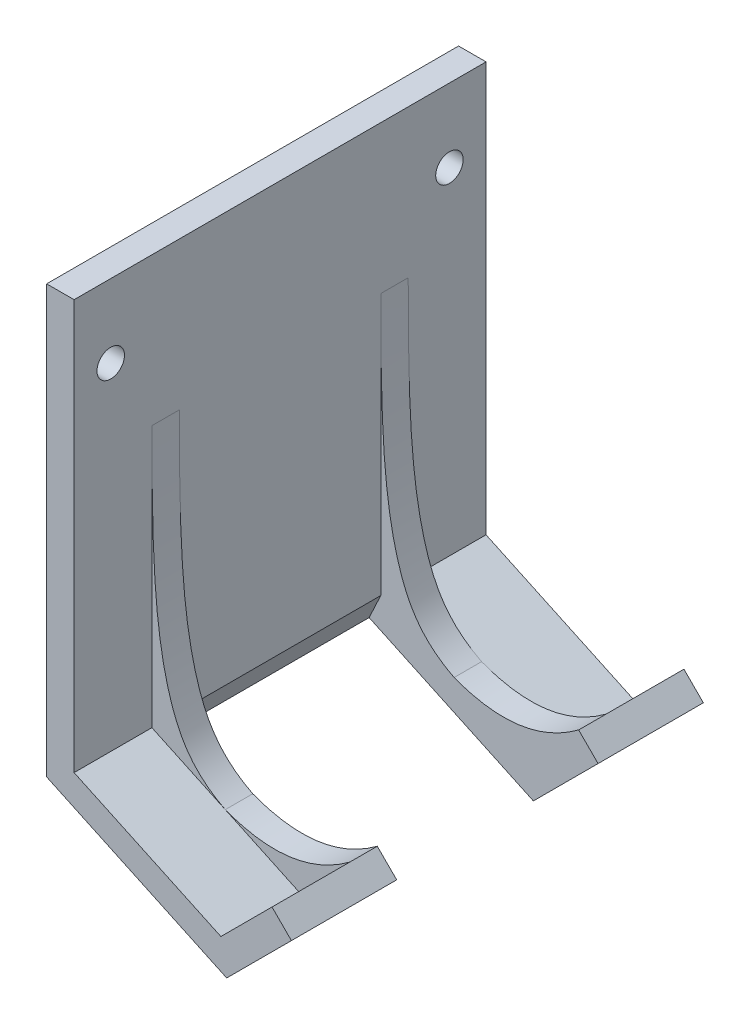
ISO-10303-21;
HEADER;
FILE_DESCRIPTION(('STEP AP214'),'2;1');
FILE_NAME('part.step','',(''),(''),'','','');
FILE_SCHEMA(('AUTOMOTIVE_DESIGN { 1 0 10303 214 1 1 1 1 }'));
ENDSEC;
DATA;
#1=APPLICATION_CONTEXT('core data for automotive mechanical design processes');
#2=APPLICATION_PROTOCOL_DEFINITION('international standard','automotive_design',2000,#1);
#3=PRODUCT_CONTEXT('',#1,'mechanical');
#4=PRODUCT('Part','Part','',(#3));
#5=PRODUCT_RELATED_PRODUCT_CATEGORY('part','',(#4));
#6=PRODUCT_DEFINITION_FORMATION('','',#4);
#7=PRODUCT_DEFINITION_CONTEXT('part definition',#1,'design');
#8=PRODUCT_DEFINITION('design','',#6,#7);
#9=PRODUCT_DEFINITION_SHAPE('','',#8);
#10=(LENGTH_UNIT() NAMED_UNIT(*) SI_UNIT(.MILLI.,.METRE.));
#11=(NAMED_UNIT(*) PLANE_ANGLE_UNIT() SI_UNIT($,.RADIAN.));
#12=(NAMED_UNIT(*) SI_UNIT($,.STERADIAN.) SOLID_ANGLE_UNIT());
#13=UNCERTAINTY_MEASURE_WITH_UNIT(LENGTH_MEASURE(1.E-05),#10,'distance_accuracy_value','');
#14=(GEOMETRIC_REPRESENTATION_CONTEXT(3) GLOBAL_UNCERTAINTY_ASSIGNED_CONTEXT((#13)) GLOBAL_UNIT_ASSIGNED_CONTEXT((#10,
#11,#12)) REPRESENTATION_CONTEXT('',''));
#15=CARTESIAN_POINT('',(0.,0.,0.));
#16=DIRECTION('',(0.,0.,1.));
#17=DIRECTION('',(1.,0.,0.));
#18=AXIS2_PLACEMENT_3D('',#15,#16,#17);
#19=CARTESIAN_POINT('',(-16.6691242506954,11.0964631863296,45.));
#20=DIRECTION('',(-1.,0.,0.));
#21=DIRECTION('',(0.,0.,1.));
#22=AXIS2_PLACEMENT_3D('',#19,#20,#21);
#23=PLANE('',#22);
#24=CARTESIAN_POINT('',(-16.6691242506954,47.8384891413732,4.));
#25=DIRECTION('',(1.,0.,0.));
#26=DIRECTION('',(0.,0.,1.));
#27=AXIS2_PLACEMENT_3D('',#24,#25,#26);
#28=CIRCLE('',#27,1.5);
#29=CARTESIAN_POINT('',(-16.6691242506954,47.8384891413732,5.50000000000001));
#30=VERTEX_POINT('',#29);
#31=EDGE_CURVE('E854',#30,#30,#28,.T.);
#32=ORIENTED_EDGE('',*,*,#31,.F.);
#33=EDGE_LOOP('',(#32));
#34=FACE_BOUND('',#33,.T.);
#35=CARTESIAN_POINT('',(-16.6691242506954,47.8384891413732,41.));
#36=DIRECTION('',(1.,0.,0.));
#37=DIRECTION('',(0.,0.,-1.));
#38=AXIS2_PLACEMENT_3D('',#35,#36,#37);
#39=CIRCLE('',#38,1.5);
#40=CARTESIAN_POINT('',(-16.6691242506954,47.8384891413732,39.5));
#41=VERTEX_POINT('',#40);
#42=EDGE_CURVE('E283',#41,#41,#39,.T.);
#43=ORIENTED_EDGE('',*,*,#42,.F.);
#44=EDGE_LOOP('',(#43));
#45=FACE_BOUND('',#44,.T.);
#46=DIRECTION('',(0.,0.,-1.));
#47=VECTOR('',#46,1.);
#48=CARTESIAN_POINT('',(-16.6691242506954,39.6694742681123,9.99999999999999));
#49=LINE('',#48,#47);
#50=CARTESIAN_POINT('',(-16.6691242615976,39.6694840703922,8.5));
#51=VERTEX_POINT('',#50);
#52=CARTESIAN_POINT('',(-16.6691242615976,39.6694840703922,11.5));
#53=VERTEX_POINT('',#52);
#54=EDGE_CURVE('E239',#51,#53,#49,.F.);
#55=ORIENTED_EDGE('',*,*,#54,.F.);
#56=DIRECTION('',(0.,-1.,0.));
#57=VECTOR('',#56,1.);
#58=CARTESIAN_POINT('',(-16.6691242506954,0.,8.5));
#59=LINE('',#58,#57);
#60=CARTESIAN_POINT('',(-16.6691242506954,11.0964631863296,8.5));
#61=VERTEX_POINT('',#60);
#62=EDGE_CURVE('E325',#51,#61,#59,.T.);
#63=ORIENTED_EDGE('',*,*,#62,.T.);
#64=DIRECTION('',(0.,0.,-1.));
#65=VECTOR('',#64,1.);
#66=CARTESIAN_POINT('',(-16.6691242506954,11.0964631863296,45.));
#67=LINE('',#66,#65);
#68=CARTESIAN_POINT('',(-16.6691242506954,11.0964631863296,0.));
#69=VERTEX_POINT('',#68);
#70=EDGE_CURVE('E337',#61,#69,#67,.T.);
#71=ORIENTED_EDGE('',*,*,#70,.T.);
#72=DIRECTION('',(0.,1.,0.));
#73=VECTOR('',#72,1.);
#74=CARTESIAN_POINT('',(-16.6691242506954,11.0964631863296,0.));
#75=LINE('',#74,#73);
#76=CARTESIAN_POINT('',(-16.6691242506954,55.8384891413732,0.));
#77=VERTEX_POINT('',#76);
#78=EDGE_CURVE('E535',#69,#77,#75,.T.);
#79=ORIENTED_EDGE('',*,*,#78,.T.);
#80=DIRECTION('',(0.,0.,-1.));
#81=VECTOR('',#80,1.);
#82=CARTESIAN_POINT('',(-16.6691242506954,55.8384891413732,45.));
#83=LINE('',#82,#81);
#84=CARTESIAN_POINT('',(-16.6691242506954,55.8384891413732,45.));
#85=VERTEX_POINT('',#84);
#86=EDGE_CURVE('E344',#85,#77,#83,.T.);
#87=ORIENTED_EDGE('',*,*,#86,.F.);
#88=DIRECTION('',(0.,1.,0.));
#89=VECTOR('',#88,1.);
#90=CARTESIAN_POINT('',(-16.6691242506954,11.0964631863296,45.));
#91=LINE('',#90,#89);
#92=CARTESIAN_POINT('',(-16.6691242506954,11.0964631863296,45.));
#93=VERTEX_POINT('',#92);
#94=EDGE_CURVE('E517',#93,#85,#91,.T.);
#95=ORIENTED_EDGE('',*,*,#94,.F.);
#96=CARTESIAN_POINT('',(-16.6691242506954,11.0964631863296,36.5));
#97=VERTEX_POINT('',#96);
#98=EDGE_CURVE('E343',#93,#97,#67,.T.);
#99=ORIENTED_EDGE('',*,*,#98,.T.);
#100=DIRECTION('',(0.,1.,0.));
#101=VECTOR('',#100,1.);
#102=CARTESIAN_POINT('',(-16.6691242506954,0.,36.5));
#103=LINE('',#102,#101);
#104=CARTESIAN_POINT('',(-16.6691242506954,39.6694840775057,36.5));
#105=VERTEX_POINT('',#104);
#106=EDGE_CURVE('E588',#97,#105,#103,.T.);
#107=ORIENTED_EDGE('',*,*,#106,.T.);
#108=CARTESIAN_POINT('',(-16.6691242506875,39.6694742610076,33.5));
#109=DIRECTION('',(0.,0.,1.));
#110=VECTOR('',#109,1.);
#111=LINE('',#108,#110);
#112=CARTESIAN_POINT('',(-16.6691242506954,39.6694840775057,33.5));
#113=VERTEX_POINT('',#112);
#114=EDGE_CURVE('E425',#105,#113,#111,.F.);
#115=ORIENTED_EDGE('',*,*,#114,.T.);
#116=DIRECTION('',(0.,1.,0.));
#117=VECTOR('',#116,1.);
#118=CARTESIAN_POINT('',(-16.6691242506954,0.,33.5));
#119=LINE('',#118,#117);
#120=CARTESIAN_POINT('',(-16.6691242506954,11.0964631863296,33.5));
#121=VERTEX_POINT('',#120);
#122=EDGE_CURVE('E595',#121,#113,#119,.T.);
#123=ORIENTED_EDGE('',*,*,#122,.F.);
#124=DIRECTION('',(0.,0.,1.));
#125=VECTOR('',#124,1.);
#126=CARTESIAN_POINT('',(-16.6691242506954,11.0964631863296,45.));
#127=LINE('',#126,#125);
#128=CARTESIAN_POINT('',(-16.6691242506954,11.0964631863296,11.5));
#129=VERTEX_POINT('',#128);
#130=EDGE_CURVE('E482',#129,#121,#127,.T.);
#131=ORIENTED_EDGE('',*,*,#130,.F.);
#132=DIRECTION('',(0.,-1.,0.));
#133=VECTOR('',#132,1.);
#134=CARTESIAN_POINT('',(-16.6691242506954,0.,11.5));
#135=LINE('',#134,#133);
#136=EDGE_CURVE('E244',#53,#129,#135,.T.);
#137=ORIENTED_EDGE('',*,*,#136,.F.);
#138=EDGE_LOOP('',(#55,#63,#71,#79,#87,#95,#99,#107,#115,#123,#131,#137));
#139=FACE_BOUND('',#138,.T.);
#140=ADVANCED_FACE('F94',(#34,#45,#139),#23,.F.);
#141=CARTESIAN_POINT('',(-0.63498678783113,3.60765389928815,45.));
#142=DIRECTION('',(-0.423173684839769,-0.906048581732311,0.));
#143=DIRECTION('',(0.906048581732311,-0.423173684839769,0.));
#144=AXIS2_PLACEMENT_3D('',#141,#142,#143);
#145=PLANE('',#144);
#146=DIRECTION('',(-0.906048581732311,0.423173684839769,0.));
#147=VECTOR('',#146,1.);
#148=CARTESIAN_POINT('',(1.26952105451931,2.71814574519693,36.5));
#149=LINE('',#148,#147);
#150=CARTESIAN_POINT('',(-0.634986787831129,3.60765389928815,36.5));
#151=VERTEX_POINT('',#150);
#152=CARTESIAN_POINT('',(-8.65205551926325,7.35205854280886,36.5));
#153=VERTEX_POINT('',#152);
#154=EDGE_CURVE('E436',#151,#153,#149,.T.);
#155=ORIENTED_EDGE('',*,*,#154,.T.);
#156=DIRECTION('',(-0.906048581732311,0.423173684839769,0.));
#157=VECTOR('',#156,1.);
#158=CARTESIAN_POINT('',(1.26952105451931,2.71814574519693,36.5));
#159=LINE('',#158,#157);
#160=EDGE_CURVE('E255',#153,#97,#159,.T.);
#161=ORIENTED_EDGE('',*,*,#160,.T.);
#162=ORIENTED_EDGE('',*,*,#98,.F.);
#163=DIRECTION('',(-0.906048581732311,0.423173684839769,0.));
#164=VECTOR('',#163,1.);
#165=CARTESIAN_POINT('',(-0.63498678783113,3.60765389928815,45.));
#166=LINE('',#165,#164);
#167=CARTESIAN_POINT('',(-0.63498678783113,3.60765389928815,45.));
#168=VERTEX_POINT('',#167);
#169=EDGE_CURVE('E515',#168,#93,#166,.T.);
#170=ORIENTED_EDGE('',*,*,#169,.F.);
#171=DIRECTION('',(0.,0.,-1.));
#172=VECTOR('',#171,1.);
#173=CARTESIAN_POINT('',(-0.63498678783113,3.60765389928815,45.));
#174=LINE('',#173,#172);
#175=EDGE_CURVE('E353',#168,#151,#174,.T.);
#176=ORIENTED_EDGE('',*,*,#175,.T.);
#177=EDGE_LOOP('',(#155,#161,#162,#170,#176));
#178=FACE_BOUND('',#177,.T.);
#179=ADVANCED_FACE('F412',(#178),#145,.F.);
#180=CARTESIAN_POINT('',(0.,0.,45.));
#181=DIRECTION('',(-0.707106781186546,0.707106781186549,0.));
#182=DIRECTION('',(-0.707106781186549,-0.707106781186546,0.));
#183=AXIS2_PLACEMENT_3D('',#180,#181,#182);
#184=PLANE('',#183);
#185=CARTESIAN_POINT('',(4.278700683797,4.27870068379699,2.5));
#186=DIRECTION('',(-0.707106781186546,0.707106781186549,0.));
#187=DIRECTION('',(-0.707106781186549,-0.707106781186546,0.));
#188=AXIS2_PLACEMENT_3D('',#185,#186,#187);
#189=CIRCLE('',#188,1.5);
#190=CARTESIAN_POINT('',(3.21804051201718,3.21804051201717,2.5));
#191=VERTEX_POINT('',#190);
#192=EDGE_CURVE('E503',#191,#191,#189,.T.);
#193=ORIENTED_EDGE('',*,*,#192,.T.);
#194=EDGE_LOOP('',(#193));
#195=FACE_BOUND('',#194,.T.);
#196=DIRECTION('',(0.707106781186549,0.707106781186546,0.));
#197=VECTOR('',#196,1.);
#198=CARTESIAN_POINT('',(0.,0.,11.5));
#199=LINE('',#198,#197);
#200=CARTESIAN_POINT('',(0.,0.,11.5));
#201=VERTEX_POINT('',#200);
#202=CARTESIAN_POINT('',(7.07106781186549,7.07106781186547,11.5));
#203=VERTEX_POINT('',#202);
#204=EDGE_CURVE('E486',#201,#203,#199,.T.);
#205=ORIENTED_EDGE('',*,*,#204,.F.);
#206=DIRECTION('',(0.,0.,-1.));
#207=VECTOR('',#206,1.);
#208=CARTESIAN_POINT('',(0.,0.,45.));
#209=LINE('',#208,#207);
#210=CARTESIAN_POINT('',(0.,0.,0.));
#211=VERTEX_POINT('',#210);
#212=EDGE_CURVE('E525',#201,#211,#209,.T.);
#213=ORIENTED_EDGE('',*,*,#212,.T.);
#214=DIRECTION('',(0.707106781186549,0.707106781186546,0.));
#215=VECTOR('',#214,1.);
#216=CARTESIAN_POINT('',(0.,0.,0.));
#217=LINE('',#216,#215);
#218=CARTESIAN_POINT('',(7.07106781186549,7.07106781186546,0.));
#219=VERTEX_POINT('',#218);
#220=EDGE_CURVE('E506',#211,#219,#217,.T.);
#221=ORIENTED_EDGE('',*,*,#220,.T.);
#222=DIRECTION('',(0.,0.,-1.));
#223=VECTOR('',#222,1.);
#224=CARTESIAN_POINT('',(7.07106781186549,7.07106781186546,45.));
#225=LINE('',#224,#223);
#226=EDGE_CURVE('E572',#203,#219,#225,.T.);
#227=ORIENTED_EDGE('',*,*,#226,.F.);
#228=EDGE_LOOP('',(#205,#213,#221,#227));
#229=FACE_BOUND('',#228,.T.);
#230=ADVANCED_FACE('F96',(#195,#229),#184,.F.);
#231=CARTESIAN_POINT('',(4.278700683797,4.27870068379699,42.5));
#232=DIRECTION('',(-0.707106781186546,0.707106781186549,0.));
#233=DIRECTION('',(-0.707106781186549,-0.707106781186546,0.));
#234=AXIS2_PLACEMENT_3D('',#231,#232,#233);
#235=CIRCLE('',#234,1.5);
#236=CARTESIAN_POINT('',(3.21804051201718,3.21804051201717,42.5));
#237=VERTEX_POINT('',#236);
#238=EDGE_CURVE('E497',#237,#237,#235,.T.);
#239=ORIENTED_EDGE('',*,*,#238,.T.);
#240=EDGE_LOOP('',(#239));
#241=FACE_BOUND('',#240,.T.);
#242=DIRECTION('',(-0.707106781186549,-0.707106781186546,0.));
#243=VECTOR('',#242,1.);
#244=CARTESIAN_POINT('',(0.,0.,33.5));
#245=LINE('',#244,#243);
#246=CARTESIAN_POINT('',(7.07106781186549,7.07106781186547,33.5));
#247=VERTEX_POINT('',#246);
#248=CARTESIAN_POINT('',(0.,0.,33.5));
#249=VERTEX_POINT('',#248);
#250=EDGE_CURVE('E483',#247,#249,#245,.T.);
#251=ORIENTED_EDGE('',*,*,#250,.F.);
#252=CARTESIAN_POINT('',(7.07106781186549,7.07106781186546,45.));
#253=VERTEX_POINT('',#252);
#254=EDGE_CURVE('E358',#253,#247,#225,.T.);
#255=ORIENTED_EDGE('',*,*,#254,.F.);
#256=DIRECTION('',(0.707106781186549,0.707106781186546,0.));
#257=VECTOR('',#256,1.);
#258=CARTESIAN_POINT('',(0.,0.,45.));
#259=LINE('',#258,#257);
#260=CARTESIAN_POINT('',(0.,0.,45.));
#261=VERTEX_POINT('',#260);
#262=EDGE_CURVE('E507',#261,#253,#259,.T.);
#263=ORIENTED_EDGE('',*,*,#262,.F.);
#264=EDGE_CURVE('E543',#261,#249,#209,.T.);
#265=ORIENTED_EDGE('',*,*,#264,.T.);
#266=EDGE_LOOP('',(#251,#255,#263,#265));
#267=FACE_BOUND('',#266,.T.);
#268=ADVANCED_FACE('F763',(#241,#267),#184,.F.);
#269=CARTESIAN_POINT('',(4.94974746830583,9.19238815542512,45.));
#270=DIRECTION('',(-0.707106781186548,-0.707106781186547,0.));
#271=DIRECTION('',(0.707106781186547,-0.707106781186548,0.));
#272=AXIS2_PLACEMENT_3D('',#269,#270,#271);
#273=PLANE('',#272);
#274=DIRECTION('',(-0.707106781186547,0.707106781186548,0.));
#275=VECTOR('',#274,1.);
#276=CARTESIAN_POINT('',(4.94974746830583,9.19238815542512,11.5));
#277=LINE('',#276,#275);
#278=CARTESIAN_POINT('',(4.94974746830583,9.19238815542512,11.5));
#279=VERTEX_POINT('',#278);
#280=EDGE_CURVE('E259',#203,#279,#277,.T.);
#281=ORIENTED_EDGE('',*,*,#280,.F.);
#282=ORIENTED_EDGE('',*,*,#226,.T.);
#283=DIRECTION('',(-0.707106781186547,0.707106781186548,0.));
#284=VECTOR('',#283,1.);
#285=CARTESIAN_POINT('',(4.94974746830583,9.19238815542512,0.));
#286=LINE('',#285,#284);
#287=CARTESIAN_POINT('',(4.94974746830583,9.19238815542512,0.));
#288=VERTEX_POINT('',#287);
#289=EDGE_CURVE('E528',#219,#288,#286,.T.);
#290=ORIENTED_EDGE('',*,*,#289,.T.);
#291=DIRECTION('',(0.,0.,-1.));
#292=VECTOR('',#291,1.);
#293=CARTESIAN_POINT('',(4.94974746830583,9.19238815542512,45.));
#294=LINE('',#293,#292);
#295=CARTESIAN_POINT('',(4.94974746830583,9.19238815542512,8.50000000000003));
#296=VERTEX_POINT('',#295);
#297=EDGE_CURVE('E355',#296,#288,#294,.T.);
#298=ORIENTED_EDGE('',*,*,#297,.F.);
#299=EDGE_CURVE('E265',#279,#296,#294,.T.);
#300=ORIENTED_EDGE('',*,*,#299,.F.);
#301=EDGE_LOOP('',(#281,#282,#290,#298,#300));
#302=FACE_BOUND('',#301,.T.);
#303=ADVANCED_FACE('F570',(#302),#273,.F.);
#304=DIRECTION('',(0.707106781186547,-0.707106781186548,0.));
#305=VECTOR('',#304,1.);
#306=CARTESIAN_POINT('',(4.94974746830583,9.19238815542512,33.5));
#307=LINE('',#306,#305);
#308=CARTESIAN_POINT('',(4.94974746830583,9.19238815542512,33.5));
#309=VERTEX_POINT('',#308);
#310=EDGE_CURVE('E468',#309,#247,#307,.T.);
#311=ORIENTED_EDGE('',*,*,#310,.F.);
#312=DIRECTION('',(0.,0.,-1.));
#313=VECTOR('',#312,1.);
#314=CARTESIAN_POINT('',(4.94974746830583,9.19238815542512,36.5));
#315=LINE('',#314,#313);
#316=CARTESIAN_POINT('',(4.94974746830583,9.19238815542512,36.5));
#317=VERTEX_POINT('',#316);
#318=EDGE_CURVE('E479',#317,#309,#315,.T.);
#319=ORIENTED_EDGE('',*,*,#318,.F.);
#320=CARTESIAN_POINT('',(4.94974746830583,9.19238815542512,45.));
#321=VERTEX_POINT('',#320);
#322=EDGE_CURVE('E363',#321,#317,#294,.T.);
#323=ORIENTED_EDGE('',*,*,#322,.F.);
#324=DIRECTION('',(-0.707106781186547,0.707106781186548,0.));
#325=VECTOR('',#324,1.);
#326=CARTESIAN_POINT('',(4.94974746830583,9.19238815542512,45.));
#327=LINE('',#326,#325);
#328=EDGE_CURVE('E510',#253,#321,#327,.T.);
#329=ORIENTED_EDGE('',*,*,#328,.F.);
#330=ORIENTED_EDGE('',*,*,#254,.T.);
#331=EDGE_LOOP('',(#311,#319,#323,#329,#330));
#332=FACE_BOUND('',#331,.T.);
#333=ADVANCED_FACE('F477',(#332),#273,.F.);
#334=CARTESIAN_POINT('',(-0.63498678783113,3.60765389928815,45.));
#335=DIRECTION('',(0.707106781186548,-0.707106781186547,0.));
#336=DIRECTION('',(0.707106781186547,0.707106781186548,0.));
#337=AXIS2_PLACEMENT_3D('',#334,#335,#336);
#338=PLANE('',#337);
#339=CARTESIAN_POINT('',(2.15738034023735,6.40002102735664,2.5));
#340=DIRECTION('',(-0.707106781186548,0.707106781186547,0.));
#341=DIRECTION('',(-0.707106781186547,-0.707106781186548,0.));
#342=AXIS2_PLACEMENT_3D('',#339,#340,#341);
#343=CIRCLE('',#342,1.5);
#344=CARTESIAN_POINT('',(1.09672016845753,5.33936085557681,2.5));
#345=VERTEX_POINT('',#344);
#346=EDGE_CURVE('E500',#345,#345,#343,.T.);
#347=ORIENTED_EDGE('',*,*,#346,.F.);
#348=EDGE_LOOP('',(#347));
#349=FACE_BOUND('',#348,.T.);
#350=CARTESIAN_POINT('',(-0.63498678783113,3.60765389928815,8.50000000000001));
#351=VERTEX_POINT('',#350);
#352=CARTESIAN_POINT('',(-0.63498678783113,3.60765389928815,0.));
#353=VERTEX_POINT('',#352);
#354=EDGE_CURVE('E347',#351,#353,#174,.T.);
#355=ORIENTED_EDGE('',*,*,#354,.F.);
#356=DIRECTION('',(0.707106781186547,0.707106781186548,0.));
#357=VECTOR('',#356,1.);
#358=CARTESIAN_POINT('',(-2.12132034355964,2.12132034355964,8.5));
#359=LINE('',#358,#357);
#360=EDGE_CURVE('E111',#351,#296,#359,.T.);
#361=ORIENTED_EDGE('',*,*,#360,.T.);
#362=ORIENTED_EDGE('',*,*,#297,.T.);
#363=DIRECTION('',(-0.707106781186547,-0.707106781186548,0.));
#364=VECTOR('',#363,1.);
#365=CARTESIAN_POINT('',(-0.63498678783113,3.60765389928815,0.));
#366=LINE('',#365,#364);
#367=EDGE_CURVE('E531',#288,#353,#366,.T.);
#368=ORIENTED_EDGE('',*,*,#367,.T.);
#369=EDGE_LOOP('',(#355,#361,#362,#368));
#370=FACE_BOUND('',#369,.T.);
#371=ADVANCED_FACE('F568',(#349,#370),#338,.F.);
#372=CARTESIAN_POINT('',(2.15738034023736,6.40002102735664,42.5));
#373=DIRECTION('',(-0.707106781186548,0.707106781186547,0.));
#374=DIRECTION('',(0.707106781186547,0.707106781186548,0.));
#375=AXIS2_PLACEMENT_3D('',#372,#373,#374);
#376=CIRCLE('',#375,1.5);
#377=CARTESIAN_POINT('',(3.21804051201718,7.46068119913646,42.5));
#378=VERTEX_POINT('',#377);
#379=EDGE_CURVE('E494',#378,#378,#376,.T.);
#380=ORIENTED_EDGE('',*,*,#379,.F.);
#381=EDGE_LOOP('',(#380));
#382=FACE_BOUND('',#381,.T.);
#383=ORIENTED_EDGE('',*,*,#322,.T.);
#384=DIRECTION('',(-0.707106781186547,-0.707106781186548,0.));
#385=VECTOR('',#384,1.);
#386=CARTESIAN_POINT('',(-2.12132034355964,2.12132034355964,36.5));
#387=LINE('',#386,#385);
#388=EDGE_CURVE('E429',#317,#151,#387,.T.);
#389=ORIENTED_EDGE('',*,*,#388,.T.);
#390=ORIENTED_EDGE('',*,*,#175,.F.);
#391=DIRECTION('',(-0.707106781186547,-0.707106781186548,0.));
#392=VECTOR('',#391,1.);
#393=CARTESIAN_POINT('',(-0.63498678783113,3.60765389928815,45.));
#394=LINE('',#393,#392);
#395=EDGE_CURVE('E513',#321,#168,#394,.T.);
#396=ORIENTED_EDGE('',*,*,#395,.F.);
#397=EDGE_LOOP('',(#383,#389,#390,#396));
#398=FACE_BOUND('',#397,.T.);
#399=ADVANCED_FACE('F579',(#382,#398),#338,.F.);
#400=DIRECTION('',(0.906048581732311,-0.423173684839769,0.));
#401=VECTOR('',#400,1.);
#402=CARTESIAN_POINT('',(1.26952105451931,2.71814574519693,8.5));
#403=LINE('',#402,#401);
#404=CARTESIAN_POINT('',(-8.65205551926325,7.35205854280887,8.5));
#405=VERTEX_POINT('',#404);
#406=EDGE_CURVE('E323',#61,#405,#403,.T.);
#407=ORIENTED_EDGE('',*,*,#406,.T.);
#408=DIRECTION('',(0.906048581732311,-0.423173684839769,0.));
#409=VECTOR('',#408,1.);
#410=CARTESIAN_POINT('',(1.26952105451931,2.71814574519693,8.5));
#411=LINE('',#410,#409);
#412=EDGE_CURVE('E119',#405,#351,#411,.T.);
#413=ORIENTED_EDGE('',*,*,#412,.T.);
#414=ORIENTED_EDGE('',*,*,#354,.T.);
#415=DIRECTION('',(-0.906048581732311,0.423173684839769,0.));
#416=VECTOR('',#415,1.);
#417=CARTESIAN_POINT('',(-0.63498678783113,3.60765389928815,0.));
#418=LINE('',#417,#416);
#419=EDGE_CURVE('E341',#353,#69,#418,.T.);
#420=ORIENTED_EDGE('',*,*,#419,.T.);
#421=ORIENTED_EDGE('',*,*,#70,.F.);
#422=EDGE_LOOP('',(#407,#413,#414,#420,#421));
#423=FACE_BOUND('',#422,.T.);
#424=ADVANCED_FACE('F339',(#423),#145,.F.);
#425=CARTESIAN_POINT('',(0.,0.,45.));
#426=DIRECTION('',(0.423173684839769,0.906048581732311,0.));
#427=DIRECTION('',(-0.906048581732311,0.423173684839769,0.));
#428=AXIS2_PLACEMENT_3D('',#425,#426,#427);
#429=PLANE('',#428);
#430=DIRECTION('',(0.906048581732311,-0.423173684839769,0.));
#431=VECTOR('',#430,1.);
#432=CARTESIAN_POINT('',(0.,0.,11.5));
#433=LINE('',#432,#431);
#434=CARTESIAN_POINT('',(-17.9386453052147,8.37831744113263,11.5));
#435=VERTEX_POINT('',#434);
#436=EDGE_CURVE('E12',#435,#201,#433,.T.);
#437=ORIENTED_EDGE('',*,*,#436,.F.);
#438=DIRECTION('',(0.,0.,-1.));
#439=VECTOR('',#438,1.);
#440=CARTESIAN_POINT('',(-17.9386453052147,8.37831744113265,45.));
#441=LINE('',#440,#439);
#442=CARTESIAN_POINT('',(-17.9386453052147,8.37831744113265,33.5));
#443=VERTEX_POINT('',#442);
#444=EDGE_CURVE('E103',#443,#435,#441,.T.);
#445=ORIENTED_EDGE('',*,*,#444,.F.);
#446=DIRECTION('',(-0.906048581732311,0.423173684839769,0.));
#447=VECTOR('',#446,1.);
#448=CARTESIAN_POINT('',(0.,0.,33.5));
#449=LINE('',#448,#447);
#450=EDGE_CURVE('E575',#249,#443,#449,.T.);
#451=ORIENTED_EDGE('',*,*,#450,.F.);
#452=ORIENTED_EDGE('',*,*,#264,.F.);
#453=DIRECTION('',(0.906048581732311,-0.423173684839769,0.));
#454=VECTOR('',#453,1.);
#455=CARTESIAN_POINT('',(0.,0.,45.));
#456=LINE('',#455,#454);
#457=CARTESIAN_POINT('',(-19.6691242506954,9.18654468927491,45.));
#458=VERTEX_POINT('',#457);
#459=EDGE_CURVE('E523',#458,#261,#456,.T.);
#460=ORIENTED_EDGE('',*,*,#459,.F.);
#461=DIRECTION('',(0.,0.,-1.));
#462=VECTOR('',#461,1.);
#463=CARTESIAN_POINT('',(-19.6691242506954,9.18654468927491,45.));
#464=LINE('',#463,#462);
#465=CARTESIAN_POINT('',(-19.6691242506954,9.18654468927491,0.));
#466=VERTEX_POINT('',#465);
#467=EDGE_CURVE('E546',#458,#466,#464,.T.);
#468=ORIENTED_EDGE('',*,*,#467,.T.);
#469=DIRECTION('',(0.906048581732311,-0.423173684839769,0.));
#470=VECTOR('',#469,1.);
#471=CARTESIAN_POINT('',(0.,0.,0.));
#472=LINE('',#471,#470);
#473=EDGE_CURVE('E511',#466,#211,#472,.T.);
#474=ORIENTED_EDGE('',*,*,#473,.T.);
#475=ORIENTED_EDGE('',*,*,#212,.F.);
#476=EDGE_LOOP('',(#437,#445,#451,#452,#460,#468,#474,#475));
#477=FACE_BOUND('',#476,.T.);
#478=ADVANCED_FACE('F398',(#477),#429,.F.);
#479=CARTESIAN_POINT('',(-19.6691242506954,55.8384891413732,45.));
#480=DIRECTION('',(0.,-1.,0.));
#481=DIRECTION('',(1.,0.,0.));
#482=AXIS2_PLACEMENT_3D('',#479,#480,#481);
#483=PLANE('',#482);
#484=DIRECTION('',(-1.,0.,0.));
#485=VECTOR('',#484,1.);
#486=CARTESIAN_POINT('',(-19.6691242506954,55.8384891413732,0.));
#487=LINE('',#486,#485);
#488=CARTESIAN_POINT('',(-19.6691242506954,55.8384891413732,0.));
#489=VERTEX_POINT('',#488);
#490=EDGE_CURVE('E537',#77,#489,#487,.T.);
#491=ORIENTED_EDGE('',*,*,#490,.T.);
#492=DIRECTION('',(0.,0.,-1.));
#493=VECTOR('',#492,1.);
#494=CARTESIAN_POINT('',(-19.6691242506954,55.8384891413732,45.));
#495=LINE('',#494,#493);
#496=CARTESIAN_POINT('',(-19.6691242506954,55.8384891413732,45.));
#497=VERTEX_POINT('',#496);
#498=EDGE_CURVE('E349',#497,#489,#495,.T.);
#499=ORIENTED_EDGE('',*,*,#498,.F.);
#500=DIRECTION('',(-1.,0.,0.));
#501=VECTOR('',#500,1.);
#502=CARTESIAN_POINT('',(-19.6691242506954,55.8384891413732,45.));
#503=LINE('',#502,#501);
#504=EDGE_CURVE('E519',#85,#497,#503,.T.);
#505=ORIENTED_EDGE('',*,*,#504,.F.);
#506=ORIENTED_EDGE('',*,*,#86,.T.);
#507=EDGE_LOOP('',(#491,#499,#505,#506));
#508=FACE_BOUND('',#507,.T.);
#509=ADVANCED_FACE('F401',(#508),#483,.F.);
#510=CARTESIAN_POINT('',(-19.6691242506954,9.18654468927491,45.));
#511=DIRECTION('',(1.,0.,0.));
#512=DIRECTION('',(0.,0.,-1.));
#513=AXIS2_PLACEMENT_3D('',#510,#511,#512);
#514=PLANE('',#513);
#515=CARTESIAN_POINT('',(-19.6691242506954,47.8384891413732,4.));
#516=DIRECTION('',(1.,0.,0.));
#517=DIRECTION('',(0.,0.,1.));
#518=AXIS2_PLACEMENT_3D('',#515,#516,#517);
#519=CIRCLE('',#518,1.5);
#520=CARTESIAN_POINT('',(-19.6691242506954,47.8384891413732,5.50000000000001));
#521=VERTEX_POINT('',#520);
#522=EDGE_CURVE('E851',#521,#521,#519,.T.);
#523=ORIENTED_EDGE('',*,*,#522,.T.);
#524=EDGE_LOOP('',(#523));
#525=FACE_BOUND('',#524,.T.);
#526=CARTESIAN_POINT('',(-19.6691242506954,47.8384891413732,41.));
#527=DIRECTION('',(1.,0.,0.));
#528=DIRECTION('',(0.,0.,-1.));
#529=AXIS2_PLACEMENT_3D('',#526,#527,#528);
#530=CIRCLE('',#529,1.5);
#531=CARTESIAN_POINT('',(-19.6691242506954,47.8384891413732,39.5));
#532=VERTEX_POINT('',#531);
#533=EDGE_CURVE('E276',#532,#532,#530,.T.);
#534=ORIENTED_EDGE('',*,*,#533,.T.);
#535=EDGE_LOOP('',(#534));
#536=FACE_BOUND('',#535,.T.);
#537=DIRECTION('',(0.,-1.,0.));
#538=VECTOR('',#537,1.);
#539=CARTESIAN_POINT('',(-19.6691242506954,9.18654468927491,0.));
#540=LINE('',#539,#538);
#541=EDGE_CURVE('E539',#489,#466,#540,.T.);
#542=ORIENTED_EDGE('',*,*,#541,.T.);
#543=ORIENTED_EDGE('',*,*,#467,.F.);
#544=DIRECTION('',(0.,-1.,0.));
#545=VECTOR('',#544,1.);
#546=CARTESIAN_POINT('',(-19.6691242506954,9.18654468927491,45.));
#547=LINE('',#546,#545);
#548=EDGE_CURVE('E521',#497,#458,#547,.T.);
#549=ORIENTED_EDGE('',*,*,#548,.F.);
#550=ORIENTED_EDGE('',*,*,#498,.T.);
#551=EDGE_LOOP('',(#542,#543,#549,#550));
#552=FACE_BOUND('',#551,.T.);
#553=ADVANCED_FACE('F393',(#525,#536,#552),#514,.F.);
#554=CARTESIAN_POINT('',(0.,0.,45.));
#555=DIRECTION('',(0.,0.,-1.));
#556=DIRECTION('',(-1.,0.,0.));
#557=AXIS2_PLACEMENT_3D('',#554,#555,#556);
#558=PLANE('',#557);
#559=ORIENTED_EDGE('',*,*,#262,.T.);
#560=ORIENTED_EDGE('',*,*,#328,.T.);
#561=ORIENTED_EDGE('',*,*,#395,.T.);
#562=ORIENTED_EDGE('',*,*,#169,.T.);
#563=ORIENTED_EDGE('',*,*,#94,.T.);
#564=ORIENTED_EDGE('',*,*,#504,.T.);
#565=ORIENTED_EDGE('',*,*,#548,.T.);
#566=ORIENTED_EDGE('',*,*,#459,.T.);
#567=EDGE_LOOP('',(#559,#560,#561,#562,#563,#564,#565,#566));
#568=FACE_BOUND('',#567,.T.);
#569=ADVANCED_FACE('F390',(#568),#558,.F.);
#570=CARTESIAN_POINT('',(0.,0.,0.));
#571=DIRECTION('',(0.,0.,-1.));
#572=DIRECTION('',(-1.,0.,0.));
#573=AXIS2_PLACEMENT_3D('',#570,#571,#572);
#574=PLANE('',#573);
#575=ORIENTED_EDGE('',*,*,#220,.F.);
#576=ORIENTED_EDGE('',*,*,#473,.F.);
#577=ORIENTED_EDGE('',*,*,#541,.F.);
#578=ORIENTED_EDGE('',*,*,#490,.F.);
#579=ORIENTED_EDGE('',*,*,#78,.F.);
#580=ORIENTED_EDGE('',*,*,#419,.F.);
#581=ORIENTED_EDGE('',*,*,#367,.F.);
#582=ORIENTED_EDGE('',*,*,#289,.F.);
#583=EDGE_LOOP('',(#575,#576,#577,#578,#579,#580,#581,#582));
#584=FACE_BOUND('',#583,.T.);
#585=ADVANCED_FACE('F388',(#584),#574,.T.);
#586=CARTESIAN_POINT('',(37.5127193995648,-28.9553180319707,2.5));
#587=DIRECTION('',(-0.707106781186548,0.707106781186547,0.));
#588=DIRECTION('',(-0.707106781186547,-0.707106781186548,0.));
#589=AXIS2_PLACEMENT_3D('',#586,#587,#588);
#590=CYLINDRICAL_SURFACE('',#589,1.5);
#591=ORIENTED_EDGE('',*,*,#346,.T.);
#592=EDGE_LOOP('',(#591));
#593=FACE_BOUND('',#592,.T.);
#594=ORIENTED_EDGE('',*,*,#192,.F.);
#595=EDGE_LOOP('',(#594));
#596=FACE_BOUND('',#595,.T.);
#597=ADVANCED_FACE('F384',(#593,#596),#590,.F.);
#598=CARTESIAN_POINT('',(37.5127193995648,-28.9553180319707,42.5));
#599=DIRECTION('',(-0.707106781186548,0.707106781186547,0.));
#600=DIRECTION('',(-0.707106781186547,-0.707106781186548,0.));
#601=AXIS2_PLACEMENT_3D('',#598,#599,#600);
#602=CYLINDRICAL_SURFACE('',#601,1.5);
#603=ORIENTED_EDGE('',*,*,#379,.T.);
#604=EDGE_LOOP('',(#603));
#605=FACE_BOUND('',#604,.T.);
#606=ORIENTED_EDGE('',*,*,#238,.F.);
#607=EDGE_LOOP('',(#606));
#608=FACE_BOUND('',#607,.T.);
#609=ADVANCED_FACE('F380',(#605,#608),#602,.F.);
#610=CARTESIAN_POINT('',(4.4895599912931,56.3988922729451,11.5));
#611=DIRECTION('',(0.,0.,1.));
#612=DIRECTION('',(1.,0.,0.));
#613=AXIS2_PLACEMENT_3D('',#610,#611,#612);
#614=PLANE('',#613);
#615=ORIENTED_EDGE('',*,*,#280,.T.);
#616=CARTESIAN_POINT('',(-140756.838550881,990063.482154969,11.5));
#617=CARTESIAN_POINT('',(145705.156572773,-989321.415049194,11.5));
#618=CARTESIAN_POINT('',(-150659.20085437,988605.078422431,11.5));
#619=B_SPLINE_CURVE_WITH_KNOTS('',2,(#616,#617,#618),.UNSPECIFIED.,.F.,.F.,(3,3),(0.,1.),.UNSPECIFIED.);
#620=CARTESIAN_POINT('',(-8.65205552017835,7.35205854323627,11.5));
#621=VERTEX_POINT('',#620);
#622=EDGE_CURVE('E245',#279,#621,#619,.T.);
#623=ORIENTED_EDGE('',*,*,#622,.T.);
#624=CARTESIAN_POINT('',(-16.6691242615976,39.6694840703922,11.5));
#625=CARTESIAN_POINT('',(-16.6568473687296,28.6311950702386,11.5));
#626=CARTESIAN_POINT('',(-16.3962517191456,16.4517325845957,11.5));
#627=CARTESIAN_POINT('',(-12.1952729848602,9.15302072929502,11.5));
#628=CARTESIAN_POINT('',(-8.65205551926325,7.35205854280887,11.5));
#629=B_SPLINE_CURVE_WITH_KNOTS('',3,(#624,#625,#626,#627,#628),.UNSPECIFIED.,.F.,.F.,(4,1,4),
(0.,0.588568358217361,0.907766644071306),.UNSPECIFIED.);
#630=EDGE_CURVE('E232',#621,#53,#629,.F.);
#631=ORIENTED_EDGE('',*,*,#630,.T.);
#632=ORIENTED_EDGE('',*,*,#136,.T.);
#633=DIRECTION('',(-0.423173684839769,-0.906048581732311,0.));
#634=VECTOR('',#633,1.);
#635=CARTESIAN_POINT('',(4.4895599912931,56.3988922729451,11.5));
#636=LINE('',#635,#634);
#637=EDGE_CURVE('E488',#129,#435,#636,.T.);
#638=ORIENTED_EDGE('',*,*,#637,.T.);
#639=ORIENTED_EDGE('',*,*,#436,.T.);
#640=ORIENTED_EDGE('',*,*,#204,.T.);
#641=EDGE_LOOP('',(#615,#623,#631,#632,#638,#639,#640));
#642=FACE_BOUND('',#641,.T.);
#643=ADVANCED_FACE('F257',(#642),#614,.T.);
#644=CARTESIAN_POINT('',(4.4895599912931,56.3988922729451,11.5));
#645=DIRECTION('',(0.906048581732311,-0.423173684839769,0.));
#646=DIRECTION('',(0.423173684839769,0.906048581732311,0.));
#647=AXIS2_PLACEMENT_3D('',#644,#645,#646);
#648=PLANE('',#647);
#649=ORIENTED_EDGE('',*,*,#130,.T.);
#650=DIRECTION('',(-0.423173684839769,-0.906048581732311,0.));
#651=VECTOR('',#650,1.);
#652=CARTESIAN_POINT('',(4.4895599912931,56.3988922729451,33.5));
#653=LINE('',#652,#651);
#654=EDGE_CURVE('E620',#121,#443,#653,.T.);
#655=ORIENTED_EDGE('',*,*,#654,.T.);
#656=ORIENTED_EDGE('',*,*,#444,.T.);
#657=ORIENTED_EDGE('',*,*,#637,.F.);
#658=EDGE_LOOP('',(#649,#655,#656,#657));
#659=FACE_BOUND('',#658,.T.);
#660=ADVANCED_FACE('F379',(#659),#648,.T.);
#661=CARTESIAN_POINT('',(4.4895599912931,56.3988922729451,33.5));
#662=DIRECTION('',(0.,0.,-1.));
#663=DIRECTION('',(-1.,0.,0.));
#664=AXIS2_PLACEMENT_3D('',#661,#662,#663);
#665=PLANE('',#664);
#666=CARTESIAN_POINT('',(4.94974746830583,9.19238815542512,33.5));
#667=CARTESIAN_POINT('',(-1.30322603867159,4.5518670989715,33.5));
#668=CARTESIAN_POINT('',(-8.65205551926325,7.35205854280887,33.5));
#669=B_SPLINE_CURVE_WITH_KNOTS('',2,(#666,#667,#668),.UNSPECIFIED.,.F.,.F.,(3,3),(0.,1.),.UNSPECIFIED.);
#670=CARTESIAN_POINT('',(-8.65205551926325,7.35205854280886,33.5));
#671=VERTEX_POINT('',#670);
#672=EDGE_CURVE('E433',#309,#671,#669,.T.);
#673=ORIENTED_EDGE('',*,*,#672,.F.);
#674=ORIENTED_EDGE('',*,*,#310,.T.);
#675=ORIENTED_EDGE('',*,*,#250,.T.);
#676=ORIENTED_EDGE('',*,*,#450,.T.);
#677=ORIENTED_EDGE('',*,*,#654,.F.);
#678=ORIENTED_EDGE('',*,*,#122,.T.);
#679=CARTESIAN_POINT('',(-8.65205551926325,7.35205854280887,33.5));
#680=CARTESIAN_POINT('',(-12.1952729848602,9.15302072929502,33.5));
#681=CARTESIAN_POINT('',(-16.8230908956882,17.1933160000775,33.5));
#682=CARTESIAN_POINT('',(-16.6691242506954,31.1565627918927,33.5));
#683=CARTESIAN_POINT('',(-16.6691242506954,45.0944821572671,33.5));
#684=B_SPLINE_CURVE_WITH_KNOTS('',3,(#679,#680,#681,#682,#683),.UNSPECIFIED.,.F.,.F.,(4,1,4),
(0.,0.319198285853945,1.),.UNSPECIFIED.);
#685=EDGE_CURVE('E471',#671,#113,#684,.T.);
#686=ORIENTED_EDGE('',*,*,#685,.F.);
#687=EDGE_LOOP('',(#673,#674,#675,#676,#677,#678,#686));
#688=FACE_BOUND('',#687,.T.);
#689=ADVANCED_FACE('F456',(#688),#665,.T.);
#690=CARTESIAN_POINT('',(4.94974746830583,9.19238815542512,36.5));
#691=CARTESIAN_POINT('',(-1.30322603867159,4.5518670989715,36.5));
#692=CARTESIAN_POINT('',(-8.65205551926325,7.35205854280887,36.5));
#693=B_SPLINE_CURVE_WITH_KNOTS('',2,(#690,#691,#692),.UNSPECIFIED.,.F.,.F.,(3,3),(0.,1.),.UNSPECIFIED.);
#694=DIRECTION('',(0.,0.,-1.));
#695=VECTOR('',#694,1.);
#696=SURFACE_OF_LINEAR_EXTRUSION('',#693,#695);
#697=ORIENTED_EDGE('',*,*,#672,.T.);
#698=DIRECTION('',(0.,0.,-1.));
#699=VECTOR('',#698,1.);
#700=CARTESIAN_POINT('',(-8.65205551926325,7.35205854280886,36.5));
#701=LINE('',#700,#699);
#702=EDGE_CURVE('E627',#153,#671,#701,.T.);
#703=ORIENTED_EDGE('',*,*,#702,.F.);
#704=EDGE_CURVE('E432',#317,#153,#693,.T.);
#705=ORIENTED_EDGE('',*,*,#704,.F.);
#706=ORIENTED_EDGE('',*,*,#318,.T.);
#707=EDGE_LOOP('',(#697,#703,#705,#706));
#708=FACE_BOUND('',#707,.T.);
#709=ADVANCED_FACE('F452',(#708),#696,.F.);
#710=CARTESIAN_POINT('',(0.,0.,36.5));
#711=DIRECTION('',(0.,0.,1.));
#712=DIRECTION('',(1.,0.,0.));
#713=AXIS2_PLACEMENT_3D('',#710,#711,#712);
#714=PLANE('',#713);
#715=ORIENTED_EDGE('',*,*,#388,.F.);
#716=ORIENTED_EDGE('',*,*,#704,.T.);
#717=ORIENTED_EDGE('',*,*,#154,.F.);
#718=EDGE_LOOP('',(#715,#716,#717));
#719=FACE_BOUND('',#718,.T.);
#720=ADVANCED_FACE('F455',(#719),#714,.T.);
#721=CARTESIAN_POINT('',(-8.65205551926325,7.35205854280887,36.5));
#722=CARTESIAN_POINT('',(-12.1952729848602,9.15302072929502,36.5));
#723=CARTESIAN_POINT('',(-16.8230908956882,17.1933160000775,36.5));
#724=CARTESIAN_POINT('',(-16.6691242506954,31.1565627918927,36.5));
#725=CARTESIAN_POINT('',(-16.6691242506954,45.0944821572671,36.5));
#726=B_SPLINE_CURVE_WITH_KNOTS('',3,(#721,#722,#723,#724,#725),.UNSPECIFIED.,.F.,.F.,(4,1,4),
(0.,0.319198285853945,1.),.UNSPECIFIED.);
#727=DIRECTION('',(0.,0.,-1.));
#728=VECTOR('',#727,1.);
#729=SURFACE_OF_LINEAR_EXTRUSION('',#726,#728);
#730=ORIENTED_EDGE('',*,*,#685,.T.);
#731=ORIENTED_EDGE('',*,*,#114,.F.);
#732=EDGE_CURVE('E593',#153,#105,#726,.T.);
#733=ORIENTED_EDGE('',*,*,#732,.F.);
#734=ORIENTED_EDGE('',*,*,#702,.T.);
#735=EDGE_LOOP('',(#730,#731,#733,#734));
#736=FACE_BOUND('',#735,.T.);
#737=ADVANCED_FACE('F615',(#736),#729,.F.);
#738=CARTESIAN_POINT('',(0.,0.,36.5));
#739=DIRECTION('',(0.,0.,1.));
#740=DIRECTION('',(1.,0.,0.));
#741=AXIS2_PLACEMENT_3D('',#738,#739,#740);
#742=PLANE('',#741);
#743=ORIENTED_EDGE('',*,*,#160,.F.);
#744=ORIENTED_EDGE('',*,*,#732,.T.);
#745=ORIENTED_EDGE('',*,*,#106,.F.);
#746=EDGE_LOOP('',(#743,#744,#745));
#747=FACE_BOUND('',#746,.T.);
#748=ADVANCED_FACE('F591',(#747),#742,.T.);
#749=CARTESIAN_POINT('',(-8.65205551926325,7.35205854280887,36.5));
#750=CARTESIAN_POINT('',(-12.1952729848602,9.15302072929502,36.5));
#751=CARTESIAN_POINT('',(-16.8230908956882,17.1933160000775,36.5));
#752=CARTESIAN_POINT('',(-16.6691242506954,31.1565627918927,36.5));
#753=CARTESIAN_POINT('',(-16.6691242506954,45.0944821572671,36.5));
#754=B_SPLINE_CURVE_WITH_KNOTS('',3,(#749,#750,#751,#752,#753),.UNSPECIFIED.,.F.,.F.,(4,1,4),
(0.,0.319198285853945,1.),.UNSPECIFIED.);
#755=DIRECTION('',(0.,0.,-1.));
#756=VECTOR('',#755,1.);
#757=SURFACE_OF_LINEAR_EXTRUSION('',#754,#756);
#758=ORIENTED_EDGE('',*,*,#630,.F.);
#759=DIRECTION('',(0.,0.,-1.));
#760=VECTOR('',#759,1.);
#761=CARTESIAN_POINT('',(-8.65205551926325,7.35205854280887,10.));
#762=LINE('',#761,#760);
#763=EDGE_CURVE('E236',#405,#621,#762,.F.);
#764=ORIENTED_EDGE('',*,*,#763,.F.);
#765=CARTESIAN_POINT('',(-8.65205551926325,7.35205854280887,8.5));
#766=CARTESIAN_POINT('',(-12.1952729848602,9.15302072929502,8.5));
#767=CARTESIAN_POINT('',(-16.3962517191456,16.4517325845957,8.5));
#768=CARTESIAN_POINT('',(-16.6568473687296,28.6311950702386,8.5));
#769=CARTESIAN_POINT('',(-16.6691242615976,39.6694840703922,8.5));
#770=B_SPLINE_CURVE_WITH_KNOTS('',3,(#765,#766,#767,#768,#769),.UNSPECIFIED.,.F.,.F.,(4,1,4),
(0.,0.319198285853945,0.907766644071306),.UNSPECIFIED.);
#771=EDGE_CURVE('E326',#405,#51,#770,.T.);
#772=ORIENTED_EDGE('',*,*,#771,.T.);
#773=ORIENTED_EDGE('',*,*,#54,.T.);
#774=EDGE_LOOP('',(#758,#764,#772,#773));
#775=FACE_BOUND('',#774,.T.);
#776=ADVANCED_FACE('F235',(#775),#757,.F.);
#777=CARTESIAN_POINT('',(0.,0.,8.5));
#778=DIRECTION('',(0.,0.,-1.));
#779=DIRECTION('',(-1.,0.,0.));
#780=AXIS2_PLACEMENT_3D('',#777,#778,#779);
#781=PLANE('',#780);
#782=ORIENTED_EDGE('',*,*,#771,.F.);
#783=ORIENTED_EDGE('',*,*,#406,.F.);
#784=ORIENTED_EDGE('',*,*,#62,.F.);
#785=EDGE_LOOP('',(#782,#783,#784));
#786=FACE_BOUND('',#785,.T.);
#787=ADVANCED_FACE('F298',(#786),#781,.T.);
#788=CARTESIAN_POINT('',(-140756.838550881,990063.482154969,8.5));
#789=CARTESIAN_POINT('',(145705.156572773,-989321.415049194,8.5));
#790=CARTESIAN_POINT('',(-150659.20085437,988605.078422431,8.5));
#791=B_SPLINE_CURVE_WITH_KNOTS('',2,(#788,#789,#790),.UNSPECIFIED.,.F.,.F.,(3,3),(0.,1.),.UNSPECIFIED.);
#792=DIRECTION('',(0.,0.,1.));
#793=VECTOR('',#792,1.);
#794=SURFACE_OF_LINEAR_EXTRUSION('',#791,#793);
#795=ORIENTED_EDGE('',*,*,#622,.F.);
#796=ORIENTED_EDGE('',*,*,#299,.T.);
#797=EDGE_CURVE('E254',#296,#405,#791,.T.);
#798=ORIENTED_EDGE('',*,*,#797,.T.);
#799=ORIENTED_EDGE('',*,*,#763,.T.);
#800=EDGE_LOOP('',(#795,#796,#798,#799));
#801=FACE_BOUND('',#800,.T.);
#802=ADVANCED_FACE('F251',(#801),#794,.T.);
#803=CARTESIAN_POINT('',(0.,0.,8.5));
#804=DIRECTION('',(0.,0.,-1.));
#805=DIRECTION('',(-1.,0.,0.));
#806=AXIS2_PLACEMENT_3D('',#803,#804,#805);
#807=PLANE('',#806);
#808=ORIENTED_EDGE('',*,*,#797,.F.);
#809=ORIENTED_EDGE('',*,*,#360,.F.);
#810=ORIENTED_EDGE('',*,*,#412,.F.);
#811=EDGE_LOOP('',(#808,#809,#810));
#812=FACE_BOUND('',#811,.T.);
#813=ADVANCED_FACE('F297',(#812),#807,.T.);
#814=CARTESIAN_POINT('',(-19.6691242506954,47.8384891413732,41.));
#815=DIRECTION('',(1.,0.,0.));
#816=DIRECTION('',(0.,0.,-1.));
#817=AXIS2_PLACEMENT_3D('',#814,#815,#816);
#818=CYLINDRICAL_SURFACE('',#817,1.5);
#819=ORIENTED_EDGE('',*,*,#533,.F.);
#820=EDGE_LOOP('',(#819));
#821=FACE_BOUND('',#820,.T.);
#822=ORIENTED_EDGE('',*,*,#42,.T.);
#823=EDGE_LOOP('',(#822));
#824=FACE_BOUND('',#823,.T.);
#825=ADVANCED_FACE('F299',(#821,#824),#818,.F.);
#826=CARTESIAN_POINT('',(-19.6691242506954,47.8384891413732,4.));
#827=DIRECTION('',(1.,0.,0.));
#828=DIRECTION('',(0.,0.,-1.));
#829=AXIS2_PLACEMENT_3D('',#826,#827,#828);
#830=CYLINDRICAL_SURFACE('',#829,1.5);
#831=ORIENTED_EDGE('',*,*,#522,.F.);
#832=EDGE_LOOP('',(#831));
#833=FACE_BOUND('',#832,.T.);
#834=ORIENTED_EDGE('',*,*,#31,.T.);
#835=EDGE_LOOP('',(#834));
#836=FACE_BOUND('',#835,.T.);
#837=ADVANCED_FACE('F666',(#833,#836),#830,.F.);
#838=CLOSED_SHELL('',(#140,#179,#230,#268,#303,#333,#371,#399,#424,#478,#509,#553,#569,#585,
#597,#609,#643,#660,#689,#709,#720,#737,#748,#776,#787,#802,#813,#825,#837));
#839=MANIFOLD_SOLID_BREP('B2',#838);
#840=ADVANCED_BREP_SHAPE_REPRESENTATION('',(#18,#839),#14);
#841=SHAPE_DEFINITION_REPRESENTATION(#9,#840);
ENDSEC;
END-ISO-10303-21;
